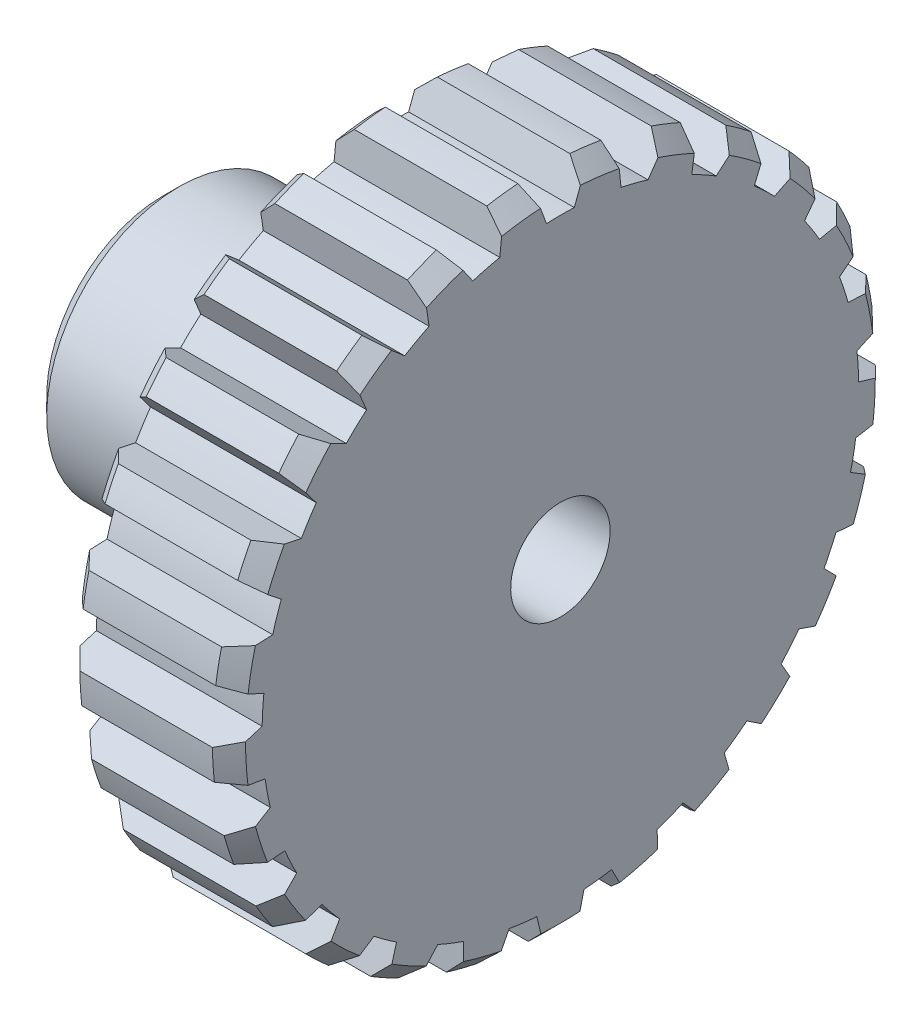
from build123d import *

# Parameters (mm, degrees)
CHAMFER4_SIZE      = 0.5
CUT_EXTRUDE2_DEPTH = 10


with BuildPart() as part:
    # Sketch1 → Revolve1 (revolve)
    with BuildSketch(Plane.XY):
        Polygon((0, 1.5), (-12, 1.5), (-12, 4), (-5, 4), (-5, 10), (0, 10), align=None)
    revolve(axis=Axis((0, 0, 0), (-1, 0, 0)))

    # Chamfer4
    chamfer4_edges = [part.edges().sort_by_distance(p)[0] for p in [
        (-12, -4, 0),
        (-5, -10, 0),
        (0, -10, 0),
    ]]
    chamfer(chamfer4_edges, length=CHAMFER4_SIZE)

    # Sketch3 → Cut-Extrude2 (cut)
    with BuildSketch(Plane(origin=(0, 0, 0), x_dir=(0, 0, -1), z_dir=(1, 0, 0))):
        with BuildLine():
            Line((-0.785, 9.969141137), (-0.42, 8.990194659))
            ThreePointArc((-0.42, 8.990194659), (0, 9), (0.42, 8.990194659))
            Line((0.42, 8.990194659), (0.785, 9.969141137))
            Line((0.785, 9.969141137), (0.785, 10.77942288))
            ThreePointArc((0.785, 10.77942288), (0, 10.807968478), (-0.785, 10.77942288))
            Line((-0.785, 10.77942288), (-0.785, 9.969141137))
        make_face()
        with BuildLine():
            Line((1.920395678, 10.63598905), (1.718886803, 9.851163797))
            Line((1.718886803, 9.851163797), (1.828965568, 8.812200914))
            ThreePointArc((1.828965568, 8.812200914), (2.238208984, 8.71724845), (2.642575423, 8.603301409))
            Line((2.642575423, 8.603301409), (3.239562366, 9.460720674))
            Line((3.239562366, 9.460720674), (3.441071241, 10.245545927))
            ThreePointArc((3.441071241, 10.245545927), (2.687832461, 10.468416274), (1.920395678, 10.63598905))
        make_face()
        with BuildLine():
            Line((4.505125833, 9.824256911), (4.114769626, 9.114201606))
            Line((4.114769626, 9.114201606), (3.963010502, 8.080504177))
            ThreePointArc((3.963010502, 8.080504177), (4.335783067, 7.88676012), (4.699108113, 7.675831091))
            Line((4.699108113, 7.675831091), (5.490571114, 8.357848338))
            Line((5.490571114, 8.357848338), (5.880927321, 9.067903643))
            ThreePointArc((5.880927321, 9.067903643), (5.206778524, 9.471094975), (4.505125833, 9.824256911))
        make_face()
        with BuildLine():
            Line((6.806782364, 8.39523058), (6.252106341, 7.804560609))
            Line((6.252106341, 7.804560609), (5.848044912, 6.841079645))
            ThreePointArc((5.848044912, 6.841079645), (6.160923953, 6.560717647), (6.460378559, 6.266060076))
            Line((6.460378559, 6.266060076), (7.396587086, 6.729821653))
            Line((7.396587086, 6.729821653), (7.951263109, 7.320491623))
            ThreePointArc((7.951263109, 7.320491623), (7.398563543, 7.878669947), (6.806782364, 8.39523058))
        make_face()
        with BuildLine():
            Line((8.680743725, 6.438701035), (7.996600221, 6.004530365))
            Line((7.996600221, 6.004530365), (7.365625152, 5.171804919))
            ThreePointArc((7.365625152, 5.171804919), (7.59895133, 4.822441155), (7.81571966, 4.462569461))
            Line((7.81571966, 4.462569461), (8.837848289, 4.678935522))
            Line((8.837848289, 4.678935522), (9.521991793, 5.113106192))
            ThreePointArc((9.521991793, 5.113106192), (9.125469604, 5.79119911), (8.680743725, 6.438701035))
        make_face()
        with BuildLine():
            Line((10.009262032, 4.077604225), (9.238638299, 3.827213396))
            Line((9.238638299, 3.827213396), (8.420396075, 3.177566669))
            ThreePointArc((8.420396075, 3.177566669), (8.559508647, 2.781152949), (8.67997035, 2.378679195))
            Line((8.67997035, 2.378679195), (9.72379498, 2.334054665))
            Line((9.72379498, 2.334054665), (10.494418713, 2.584445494))
            ThreePointArc((10.494418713, 2.584445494), (10.278988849, 3.339845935), (10.009262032, 4.077604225))
        make_face()
        with BuildLine():
            Line((10.708861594, 1.460296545), (9.900178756, 1.409418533))
            Line((9.900178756, 1.409418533), (8.946082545, 0.983670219))
            ThreePointArc((8.946082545, 0.983670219), (8.982240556, 0.565114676), (8.998826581, 0.145327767))
            Line((8.998826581, 0.145327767), (9.998759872, -0.157483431))
            Line((9.998759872, -0.157483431), (10.807442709, -0.106605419))
            ThreePointArc((10.807442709, -0.106605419), (10.786641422, 0.678637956), (10.708861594, 1.460296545))
        make_face()
        with BuildLine():
            Line((10.735583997, -1.248766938), (9.939654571, -1.09693528))
            Line((9.939654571, -1.09693528), (8.909653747, -1.272033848))
            ThreePointArc((8.909653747, -1.272033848), (8.840585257, -1.686431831), (8.752253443, -2.097155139))
            Line((8.752253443, -2.097155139), (9.645465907, -2.639126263))
            Line((9.645465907, -2.639126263), (10.441395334, -2.790957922))
            ThreePointArc((10.441395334, -2.790957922), (10.616529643, -2.025211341), (10.735583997, -1.248766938))
        make_face()
        with BuildLine():
            Line((10.087750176, -3.879365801), (9.354585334, -3.534364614))
            Line((9.354585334, -3.534364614), (8.313398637, -3.447811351))
            ThreePointArc((8.313398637, -3.447811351), (8.143443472, -3.832013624), (7.955744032, -4.207866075))
            Line((7.955744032, -4.207866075), (8.686111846, -4.954943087))
            Line((8.686111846, -4.954943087), (9.419276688, -5.299944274))
            ThreePointArc((9.419276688, -5.299944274), (9.779342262, -4.601809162), (10.087750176, -3.879365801))
        make_face()
        with BuildLine():
            Line((8.806065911, -6.266209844), (8.181733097, -5.749716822))
            Line((8.181733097, -5.749716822), (7.194782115, -5.406950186))
            ThreePointArc((7.194782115, -5.406950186), (6.934619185, -5.736815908), (6.659345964, -6.05418131))
            Line((6.659345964, -6.05418131), (7.180977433, -6.959422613))
            Line((7.180977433, -6.959422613), (7.805310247, -7.475915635))
            ThreePointArc((7.805310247, -7.475915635), (8.32768284, -6.889258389), (8.806065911, -6.266209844))
        make_face()
        with BuildLine():
            Line((6.971064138, -8.259324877), (6.494792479, -7.603793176))
            Line((6.494792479, -7.603793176), (5.624090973, -7.026350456))
            ThreePointArc((5.624090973, -7.026350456), (5.290067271, -7.281152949), (4.944516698, -7.520090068))
            Line((4.944516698, -7.520090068), (5.224635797, -8.526616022))
            Line((5.224635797, -8.526616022), (5.700907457, -9.182147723))
            ThreePointArc((5.700907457, -9.182147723), (6.352764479, -8.743830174), (6.971064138, -8.259324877))
        make_face()
        with BuildLine():
            Line((4.698044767, -9.733476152), (4.399760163, -8.980095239))
            Line((4.399760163, -8.980095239), (3.700017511, -8.204259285))
            ThreePointArc((3.700017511, -8.204259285), (3.313120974, -8.367988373), (2.919005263, -8.513483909))
            Line((2.919005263, -8.513483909), (2.94001108, -9.558050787))
            Line((2.94001108, -9.558050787), (3.238295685, -10.311431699))
            ThreePointArc((3.238295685, -10.311431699), (3.978678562, -10.048994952), (4.698044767, -9.733476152))
        make_face()
        with BuildLine():
            Line((2.129829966, -10.596037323), (2.028274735, -9.792144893))
            Line((2.028274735, -9.792144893), (1.543458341, -8.86666433))
            ThreePointArc((1.543458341, -8.86666433), (1.127999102, -8.929032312), (0.710081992, -8.971944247))
            Line((0.710081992, -8.971944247), (0.470654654, -9.988918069))
            Line((0.470654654, -9.988918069), (0.572209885, -10.7928105))
            ThreePointArc((0.572209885, -10.7928105), (1.354597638, -10.722744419), (2.129829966, -10.596037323))
        make_face()
        with BuildLine():
            Line((-0.572209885, -10.7928105), (-0.470654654, -9.988918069))
            Line((-0.470654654, -9.988918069), (-0.710081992, -8.971944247))
            ThreePointArc((-0.710081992, -8.971944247), (-1.127999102, -8.929032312), (-1.543458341, -8.86666433))
            Line((-1.543458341, -8.86666433), (-2.028274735, -9.792144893))
            Line((-2.028274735, -9.792144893), (-2.129829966, -10.596037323))
            ThreePointArc((-2.129829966, -10.596037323), (-1.354597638, -10.722744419), (-0.572209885, -10.7928105))
        make_face()
        with BuildLine():
            Line((-3.238295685, -10.311431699), (-2.94001108, -9.558050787))
            Line((-2.94001108, -9.558050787), (-2.919005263, -8.513483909))
            ThreePointArc((-2.919005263, -8.513483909), (-3.313120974, -8.367988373), (-3.700017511, -8.204259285))
            Line((-3.700017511, -8.204259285), (-4.399760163, -8.980095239))
            Line((-4.399760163, -8.980095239), (-4.698044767, -9.733476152))
            ThreePointArc((-4.698044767, -9.733476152), (-3.978678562, -10.048994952), (-3.238295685, -10.311431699))
        make_face()
        with BuildLine():
            Line((-5.700907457, -9.182147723), (-5.224635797, -8.526616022))
            Line((-5.224635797, -8.526616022), (-4.944516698, -7.520090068))
            ThreePointArc((-4.944516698, -7.520090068), (-5.290067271, -7.281152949), (-5.624090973, -7.026350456))
            Line((-5.624090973, -7.026350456), (-6.494792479, -7.603793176))
            Line((-6.494792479, -7.603793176), (-6.971064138, -8.259324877))
            ThreePointArc((-6.971064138, -8.259324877), (-6.352764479, -8.743830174), (-5.700907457, -9.182147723))
        make_face()
        with BuildLine():
            Line((-7.805310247, -7.475915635), (-7.180977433, -6.959422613))
            Line((-7.180977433, -6.959422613), (-6.659345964, -6.05418131))
            ThreePointArc((-6.659345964, -6.05418131), (-6.934619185, -5.736815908), (-7.194782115, -5.406950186))
            Line((-7.194782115, -5.406950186), (-8.181733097, -5.749716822))
            Line((-8.181733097, -5.749716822), (-8.806065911, -6.266209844))
            ThreePointArc((-8.806065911, -6.266209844), (-8.32768284, -6.889258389), (-7.805310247, -7.475915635))
        make_face()
        with BuildLine():
            Line((-9.419276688, -5.299944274), (-8.686111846, -4.954943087))
            Line((-8.686111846, -4.954943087), (-7.955744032, -4.207866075))
            ThreePointArc((-7.955744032, -4.207866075), (-8.143443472, -3.832013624), (-8.313398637, -3.447811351))
            Line((-8.313398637, -3.447811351), (-9.354585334, -3.534364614))
            Line((-9.354585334, -3.534364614), (-10.087750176, -3.879365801))
            ThreePointArc((-10.087750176, -3.879365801), (-9.779342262, -4.601809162), (-9.419276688, -5.299944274))
        make_face()
        with BuildLine():
            Line((-10.441395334, -2.790957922), (-9.645465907, -2.639126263))
            Line((-9.645465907, -2.639126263), (-8.752253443, -2.097155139))
            ThreePointArc((-8.752253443, -2.097155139), (-8.840585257, -1.686431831), (-8.909653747, -1.272033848))
            Line((-8.909653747, -1.272033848), (-9.939654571, -1.09693528))
            Line((-9.939654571, -1.09693528), (-10.735583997, -1.248766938))
            ThreePointArc((-10.735583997, -1.248766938), (-10.616529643, -2.025211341), (-10.441395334, -2.790957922))
        make_face()
        with BuildLine():
            Line((-10.807442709, -0.106605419), (-9.998759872, -0.157483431))
            Line((-9.998759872, -0.157483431), (-8.998826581, 0.145327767))
            ThreePointArc((-8.998826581, 0.145327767), (-8.982240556, 0.565114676), (-8.946082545, 0.983670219))
            Line((-8.946082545, 0.983670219), (-9.900178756, 1.409418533))
            Line((-9.900178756, 1.409418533), (-10.708861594, 1.460296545))
            ThreePointArc((-10.708861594, 1.460296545), (-10.786641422, 0.678637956), (-10.807442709, -0.106605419))
        make_face()
        with BuildLine():
            Line((-10.494418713, 2.584445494), (-9.72379498, 2.334054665))
            Line((-9.72379498, 2.334054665), (-8.67997035, 2.378679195))
            ThreePointArc((-8.67997035, 2.378679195), (-8.559508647, 2.781152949), (-8.420396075, 3.177566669))
            Line((-8.420396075, 3.177566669), (-9.238638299, 3.827213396))
            Line((-9.238638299, 3.827213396), (-10.009262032, 4.077604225))
            ThreePointArc((-10.009262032, 4.077604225), (-10.278988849, 3.339845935), (-10.494418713, 2.584445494))
        make_face()
        with BuildLine():
            Line((-9.521991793, 5.113106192), (-8.837848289, 4.678935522))
            Line((-8.837848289, 4.678935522), (-7.81571966, 4.462569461))
            ThreePointArc((-7.81571966, 4.462569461), (-7.59895133, 4.822441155), (-7.365625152, 5.171804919))
            Line((-7.365625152, 5.171804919), (-7.996600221, 6.004530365))
            Line((-7.996600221, 6.004530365), (-8.680743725, 6.438701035))
            ThreePointArc((-8.680743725, 6.438701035), (-9.125469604, 5.79119911), (-9.521991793, 5.113106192))
        make_face()
        with BuildLine():
            Line((-7.951263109, 7.320491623), (-7.396587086, 6.729821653))
            Line((-7.396587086, 6.729821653), (-6.460378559, 6.266060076))
            ThreePointArc((-6.460378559, 6.266060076), (-6.160923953, 6.560717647), (-5.848044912, 6.841079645))
            Line((-5.848044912, 6.841079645), (-6.252106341, 7.804560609))
            Line((-6.252106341, 7.804560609), (-6.806782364, 8.39523058))
            ThreePointArc((-6.806782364, 8.39523058), (-7.398563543, 7.878669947), (-7.951263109, 7.320491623))
        make_face()
        with BuildLine():
            Line((-5.880927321, 9.067903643), (-5.490571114, 8.357848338))
            Line((-5.490571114, 8.357848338), (-4.699108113, 7.675831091))
            ThreePointArc((-4.699108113, 7.675831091), (-4.335783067, 7.88676012), (-3.963010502, 8.080504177))
            Line((-3.963010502, 8.080504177), (-4.114769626, 9.114201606))
            Line((-4.114769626, 9.114201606), (-4.505125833, 9.824256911))
            ThreePointArc((-4.505125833, 9.824256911), (-5.206778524, 9.471094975), (-5.880927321, 9.067903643))
        make_face()
        with BuildLine():
            Line((-3.441071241, 10.245545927), (-3.239562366, 9.460720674))
            Line((-3.239562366, 9.460720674), (-2.642575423, 8.603301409))
            ThreePointArc((-2.642575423, 8.603301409), (-2.238208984, 8.71724845), (-1.828965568, 8.812200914))
            Line((-1.828965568, 8.812200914), (-1.718886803, 9.851163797))
            Line((-1.718886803, 9.851163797), (-1.920395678, 10.63598905))
            ThreePointArc((-1.920395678, 10.63598905), (-2.687832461, 10.468416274), (-3.441071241, 10.245545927))
        make_face()
    extrude(amount=-CUT_EXTRUDE2_DEPTH, mode=Mode.SUBTRACT)


solid = part.part
